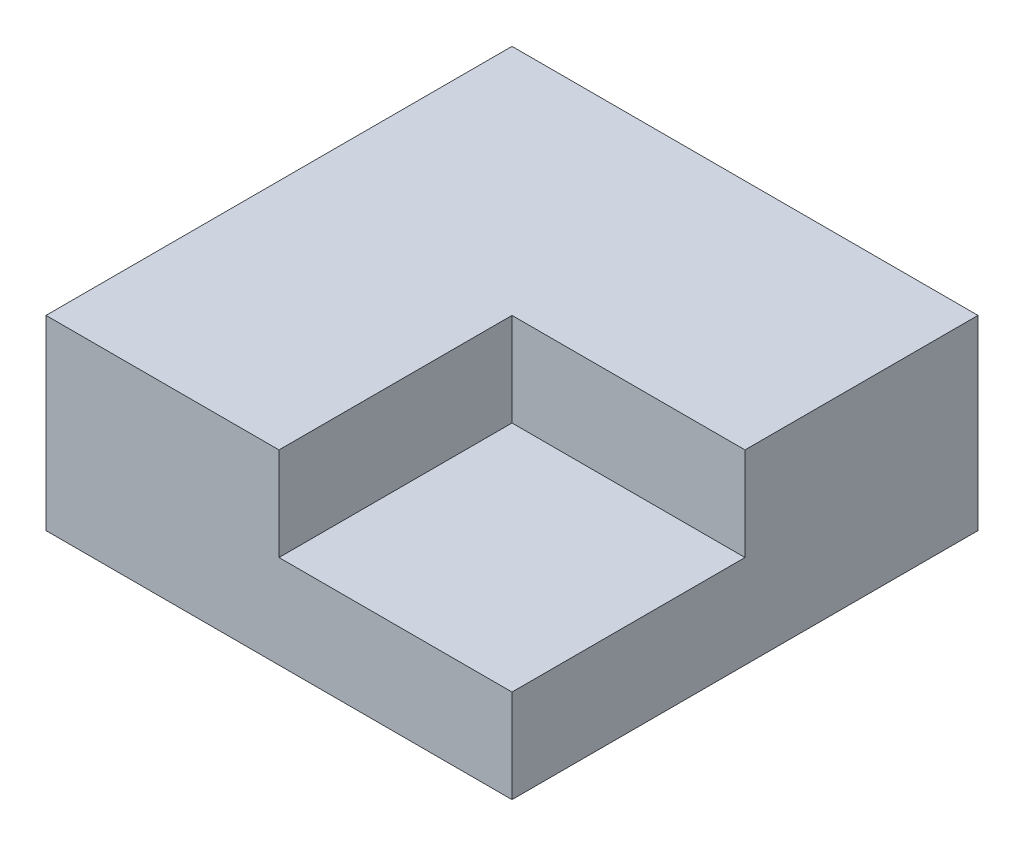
from build123d import *

# Parameters (mm, degrees)
SKETCH1_W          = 50
SKETCH1_H          = 50
EXTRUDE1_DEPTH     = 20
SKETCH2_W          = 25
SKETCH2_H          = 25
CUT_EXTRUDE1_DEPTH = 10


with BuildPart() as part:
    # Sketch1 → Extrude1 (new body)
    with BuildSketch(Plane(origin=(0, 0, 0), x_dir=(1, 0, 0), z_dir=(0, 1, 0))):
        with Locations((25, 25)):
            Rectangle(SKETCH1_W, SKETCH1_H)
    extrude(amount=EXTRUDE1_DEPTH)

    # Sketch2 → Cut-Extrude1 (cut)
    with BuildSketch(Plane(origin=(0, 20, 0), x_dir=(-1, 0, 0), z_dir=(0, 1, 0))):
        with Locations((-37.5, -12.5)):
            Rectangle(SKETCH2_W, SKETCH2_H)
    extrude(amount=-CUT_EXTRUDE1_DEPTH, mode=Mode.SUBTRACT)


solid = part.part
